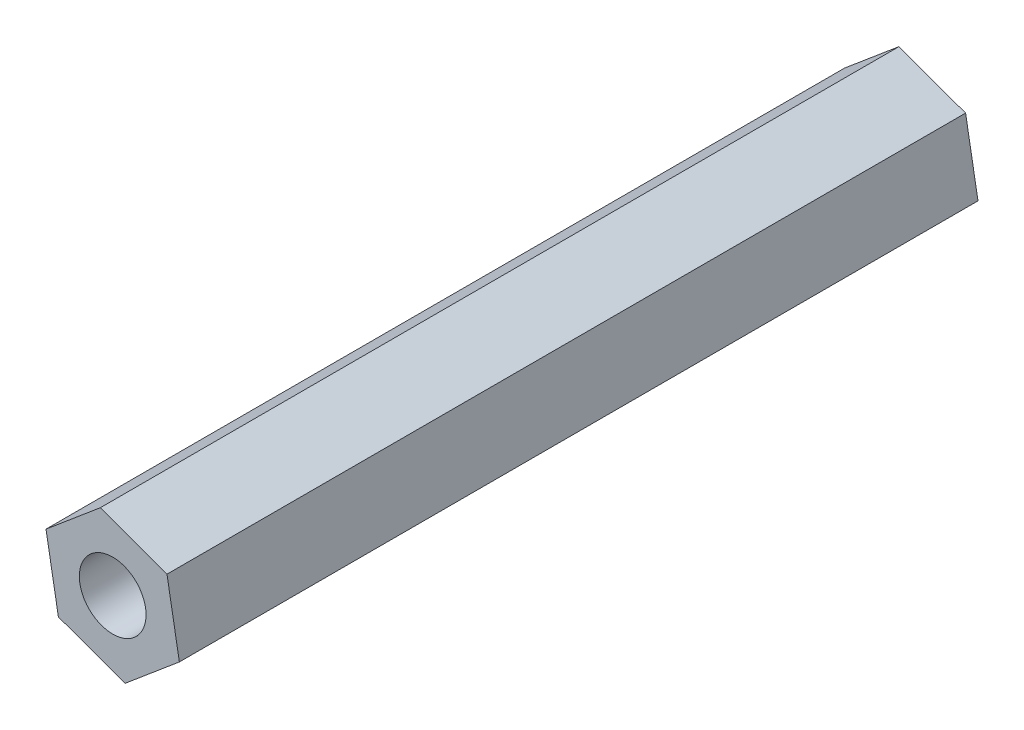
from build123d import *

# Parameters (mm, degrees)
BOSS_EXTRUDE1_DEPTH = 41.275
SKETCH2_R           = 1.72421427
CUT_EXTRUDE1_DEPTH  = 42.575644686


with BuildPart() as part:
    # Sketch1 → Boss-Extrude1 (new body)
    with BuildSketch(Plane.XY):
        Polygon((3.44648221, -1.250037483), (2.805805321, 2.359722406), (-0.640676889, 3.609759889), (-3.44648221, 1.250037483), (-2.805805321, -2.359722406), (0.640676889, -3.609759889), align=None)
    extrude(amount=BOSS_EXTRUDE1_DEPTH)

    # Sketch2 → Cut-Extrude1 (cut, through all)
    with BuildSketch(Plane.XY.offset(41.275)):
        Circle(SKETCH2_R)
    extrude(amount=-CUT_EXTRUDE1_DEPTH, mode=Mode.SUBTRACT)


solid = part.part
